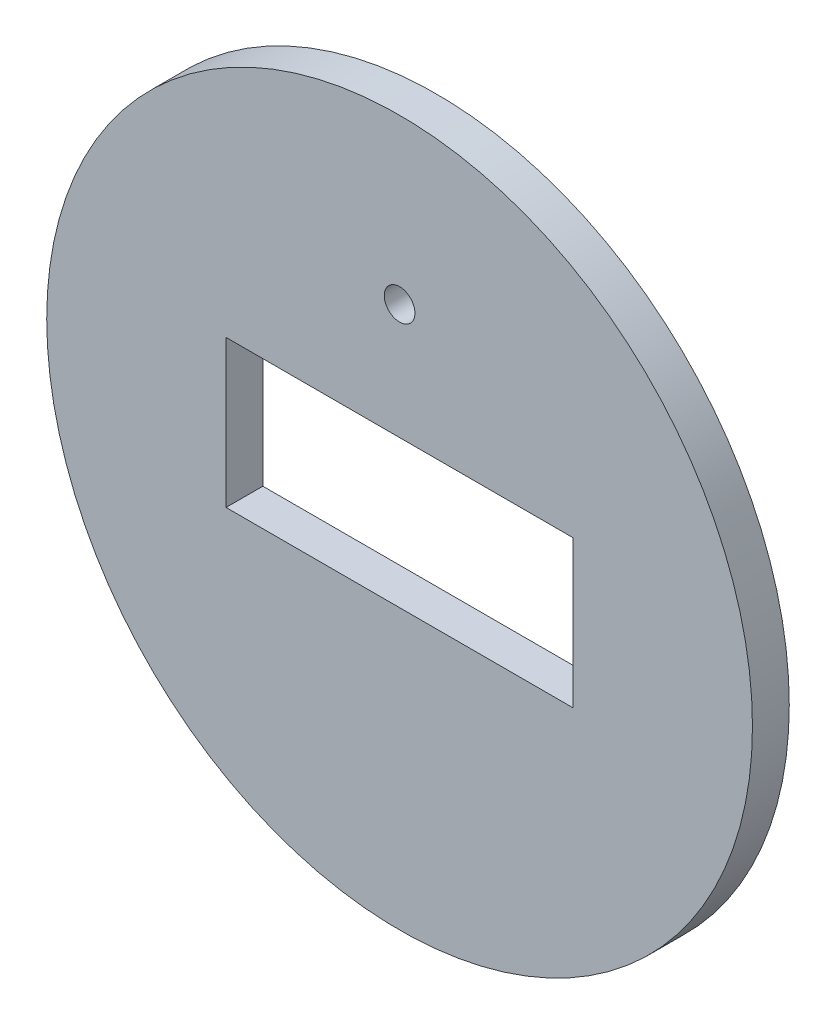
from build123d import *

# Parameters (mm, degrees)
SKETCH1_R          = 36.5125
EXTRUDE1_DEPTH     = 3.81
SKETCH2_R          = 1.5875
CUT_EXTRUDE1_DEPTH = 52.776842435
SKETCH3_W          = 35.9156
SKETCH3_H          = 15.24
CUT_EXTRUDE2_DEPTH = 52.776842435


with BuildPart() as part:
    # Sketch1 → Extrude1 (new body)
    with BuildSketch(Plane.XY):
        with Locations(Location((0, 0, 0), (0, 0, 180))):
            Circle(SKETCH1_R)
    extrude(amount=EXTRUDE1_DEPTH)

    # Sketch2 → Cut-Extrude1 (cut, through all)
    with BuildSketch(Plane.XY):
        with Locations(Location((0, 19.558, 0), (0, 0, 180))):
            Circle(SKETCH2_R)
    extrude(amount=CUT_EXTRUDE1_DEPTH, mode=Mode.SUBTRACT)

    # Sketch3 → Cut-Extrude2 (cut, through all)
    with BuildSketch(Plane.XY):
        Rectangle(SKETCH3_W, SKETCH3_H)
    extrude(amount=CUT_EXTRUDE2_DEPTH, mode=Mode.SUBTRACT)


solid = part.part
